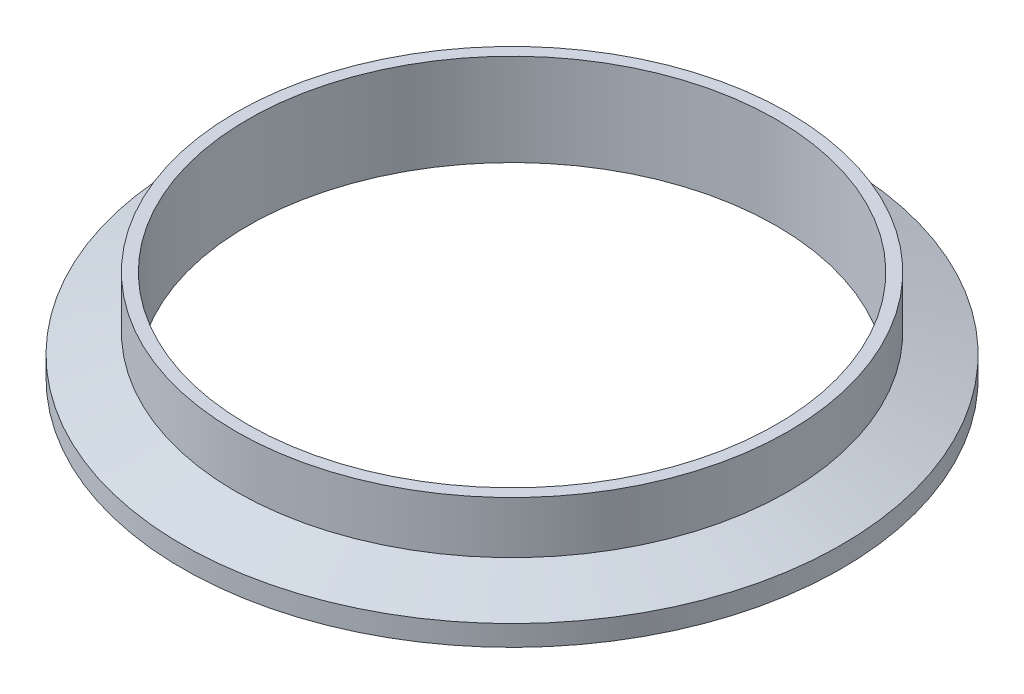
from build123d import *


with BuildPart() as part:
    # Sketch1 → Revolve2 (revolve)
    with BuildSketch(Plane.XY, mode=Mode.PRIVATE) as revolve2_sk:
        with BuildLine():
            Line((-36.449, 0), (-36.449, 12.7))
            Line((-36.449, 12.7), (-38.1, 12.7))
            Line((-38.1, 12.7), (-38.1, 5.521182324))
            Line((-38.1, 5.521182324), (-45.4533, 2.8448))
            Line((-45.4533, 2.8448), (-45.4533, 0))
            Line((-45.4533, 0), (-43.486708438, 0))
            ThreePointArc((-43.486708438, 0), (-43.054511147, 0.129217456), (-42.764166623, 0.474458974))
            ThreePointArc((-42.764166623, 0.474458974), (-41.6687, 1.1938), (-40.573233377, 0.474458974))
            ThreePointArc((-40.573233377, 0.474458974), (-40.282888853, 0.129217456), (-39.850691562, 0))
            Line((-39.850691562, 0), (-36.449, 0))
        make_face()
    revolve(revolve2_sk.sketch.rotate(Axis((0, 0, 0), (0, 1, 0)), 270), axis=Axis((0, 0, 0), (0, 1, 0)))


solid = part.part
